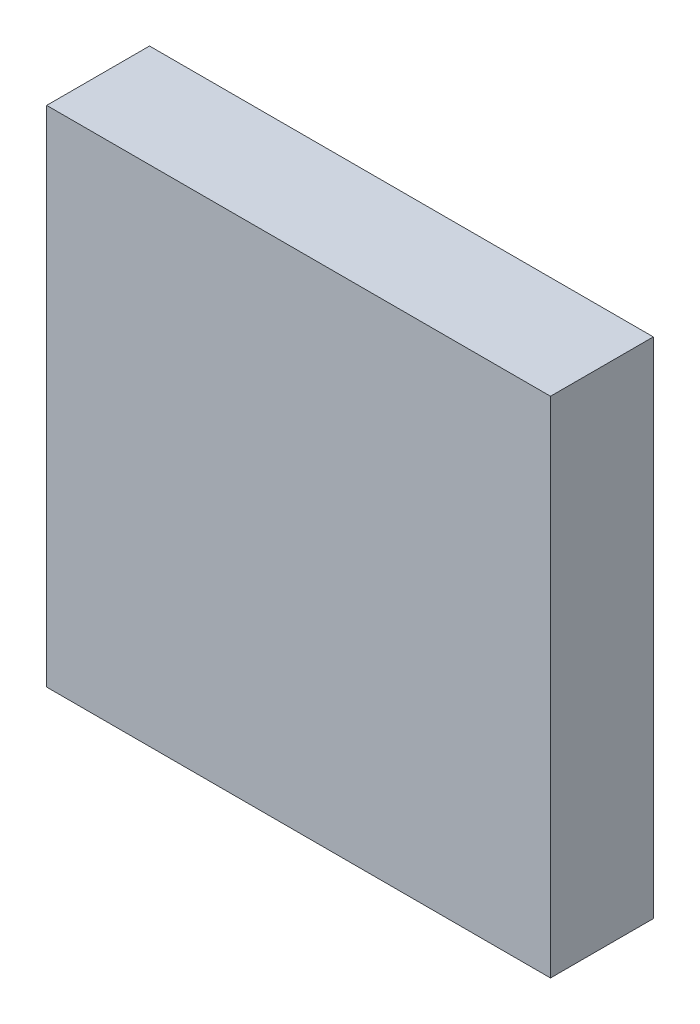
from build123d import *

# Parameters (mm, degrees)
SKETCH1_W      = 4.9
SKETCH1_H      = 4.9
EXTRUDE1_DEPTH = 1


with BuildPart() as part:
    # Sketch1 → Extrude1 (new body)
    with BuildSketch(Plane.XY):
        with Locations((2.45, 2.45)):
            Rectangle(SKETCH1_W, SKETCH1_H)
    extrude(amount=EXTRUDE1_DEPTH)


solid = part.part
